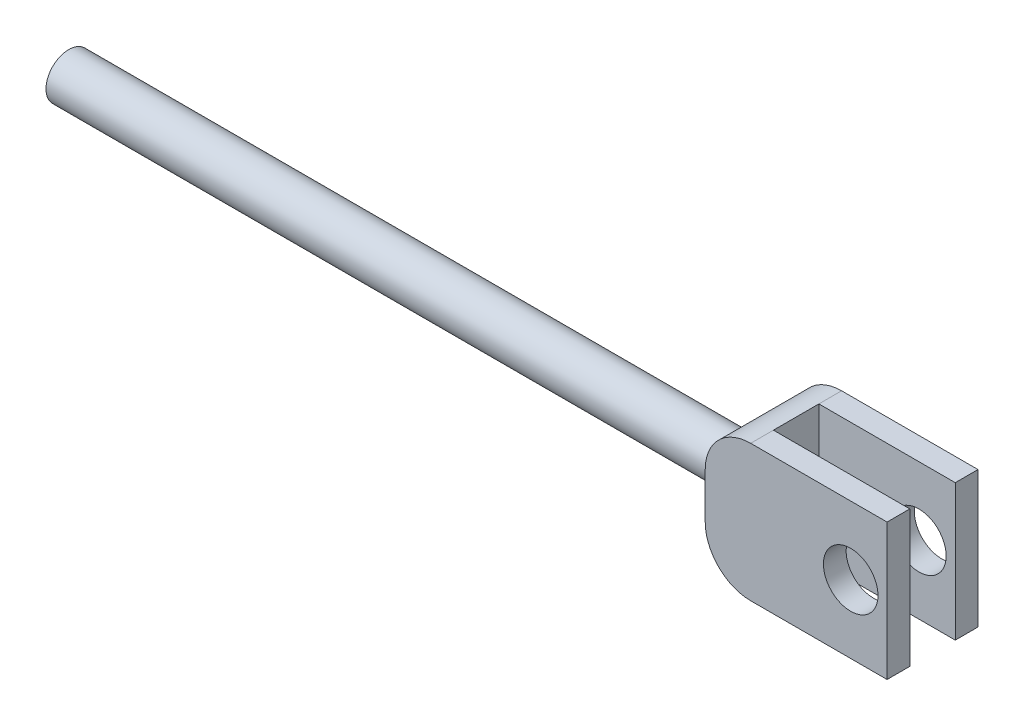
ISO-10303-21;
HEADER;
FILE_DESCRIPTION(('STEP AP214'),'2;1');
FILE_NAME('part.step','',(''),(''),'','','');
FILE_SCHEMA(('AUTOMOTIVE_DESIGN { 1 0 10303 214 1 1 1 1 }'));
ENDSEC;
DATA;
#1=APPLICATION_CONTEXT('core data for automotive mechanical design processes');
#2=APPLICATION_PROTOCOL_DEFINITION('international standard','automotive_design',2000,#1);
#3=PRODUCT_CONTEXT('',#1,'mechanical');
#4=PRODUCT('Part','Part','',(#3));
#5=PRODUCT_RELATED_PRODUCT_CATEGORY('part','',(#4));
#6=PRODUCT_DEFINITION_FORMATION('','',#4);
#7=PRODUCT_DEFINITION_CONTEXT('part definition',#1,'design');
#8=PRODUCT_DEFINITION('design','',#6,#7);
#9=PRODUCT_DEFINITION_SHAPE('','',#8);
#10=(LENGTH_UNIT() NAMED_UNIT(*) SI_UNIT(.MILLI.,.METRE.));
#11=(NAMED_UNIT(*) PLANE_ANGLE_UNIT() SI_UNIT($,.RADIAN.));
#12=(NAMED_UNIT(*) SI_UNIT($,.STERADIAN.) SOLID_ANGLE_UNIT());
#13=UNCERTAINTY_MEASURE_WITH_UNIT(LENGTH_MEASURE(1.E-05),#10,'distance_accuracy_value','');
#14=(GEOMETRIC_REPRESENTATION_CONTEXT(3) GLOBAL_UNCERTAINTY_ASSIGNED_CONTEXT((#13)) GLOBAL_UNIT_ASSIGNED_CONTEXT((#10,
#11,#12)) REPRESENTATION_CONTEXT('',''));
#15=CARTESIAN_POINT('',(0.,0.,0.));
#16=DIRECTION('',(0.,0.,1.));
#17=DIRECTION('',(1.,0.,0.));
#18=AXIS2_PLACEMENT_3D('',#15,#16,#17);
#19=CARTESIAN_POINT('',(-40.,30.,20.));
#20=DIRECTION('',(1.,0.,0.));
#21=DIRECTION('',(0.,1.,0.));
#22=AXIS2_PLACEMENT_3D('',#19,#20,#21);
#23=PLANE('',#22);
#24=CARTESIAN_POINT('',(-40.,15.,10.));
#25=DIRECTION('',(-1.,0.,0.));
#26=DIRECTION('',(0.,-1.,0.));
#27=AXIS2_PLACEMENT_3D('',#24,#25,#26);
#28=CIRCLE('',#27,5.);
#29=CARTESIAN_POINT('',(-40.,20.,10.));
#30=VERTEX_POINT('',#29);
#31=CARTESIAN_POINT('',(-40.,9.99999999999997,10.));
#32=VERTEX_POINT('',#31);
#33=EDGE_CURVE('E135',#30,#32,#28,.T.);
#34=ORIENTED_EDGE('',*,*,#33,.F.);
#35=DIRECTION('',(0.,0.,-1.));
#36=VECTOR('',#35,1.);
#37=CARTESIAN_POINT('',(-40.,20.,20.));
#38=LINE('',#37,#36);
#39=CARTESIAN_POINT('',(-40.,20.,0.));
#40=VERTEX_POINT('',#39);
#41=EDGE_CURVE('E123',#30,#40,#38,.T.);
#42=ORIENTED_EDGE('',*,*,#41,.T.);
#43=DIRECTION('',(0.,-1.,0.));
#44=VECTOR('',#43,1.);
#45=CARTESIAN_POINT('',(-40.,30.,0.));
#46=LINE('',#45,#44);
#47=CARTESIAN_POINT('',(-40.,9.99999999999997,0.));
#48=VERTEX_POINT('',#47);
#49=EDGE_CURVE('E194',#40,#48,#46,.T.);
#50=ORIENTED_EDGE('',*,*,#49,.T.);
#51=DIRECTION('',(0.,0.,-1.));
#52=VECTOR('',#51,1.);
#53=CARTESIAN_POINT('',(-40.,9.99999999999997,20.));
#54=LINE('',#53,#52);
#55=EDGE_CURVE('E137',#48,#32,#54,.F.);
#56=ORIENTED_EDGE('',*,*,#55,.T.);
#57=EDGE_LOOP('',(#34,#42,#50,#56));
#58=FACE_BOUND('',#57,.T.);
#59=ADVANCED_FACE('F31',(#58),#23,.F.);
#60=EDGE_CURVE('E48',#32,#30,#28,.T.);
#61=ORIENTED_EDGE('',*,*,#60,.F.);
#62=CARTESIAN_POINT('',(-40.,9.99999999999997,20.));
#63=VERTEX_POINT('',#62);
#64=EDGE_CURVE('E122',#32,#63,#54,.F.);
#65=ORIENTED_EDGE('',*,*,#64,.T.);
#66=DIRECTION('',(0.,-1.,0.));
#67=VECTOR('',#66,1.);
#68=CARTESIAN_POINT('',(-40.,30.,20.));
#69=LINE('',#68,#67);
#70=CARTESIAN_POINT('',(-40.,20.,20.));
#71=VERTEX_POINT('',#70);
#72=EDGE_CURVE('E119',#71,#63,#69,.T.);
#73=ORIENTED_EDGE('',*,*,#72,.F.);
#74=EDGE_CURVE('E115',#71,#30,#38,.T.);
#75=ORIENTED_EDGE('',*,*,#74,.T.);
#76=EDGE_LOOP('',(#61,#65,#73,#75));
#77=FACE_BOUND('',#76,.T.);
#78=ADVANCED_FACE('F117',(#77),#23,.F.);
#79=CARTESIAN_POINT('',(0.,30.,20.));
#80=DIRECTION('',(-1.,0.,0.));
#81=DIRECTION('',(0.,-1.,0.));
#82=AXIS2_PLACEMENT_3D('',#79,#80,#81);
#83=PLANE('',#82);
#84=DIRECTION('',(0.,0.,-1.));
#85=VECTOR('',#84,1.);
#86=CARTESIAN_POINT('',(0.,0.,20.));
#87=LINE('',#86,#85);
#88=CARTESIAN_POINT('',(0.,0.,20.));
#89=VERTEX_POINT('',#88);
#90=CARTESIAN_POINT('',(0.,0.,15.));
#91=VERTEX_POINT('',#90);
#92=EDGE_CURVE('E198',#89,#91,#87,.T.);
#93=ORIENTED_EDGE('',*,*,#92,.T.);
#94=DIRECTION('',(0.,-1.,0.));
#95=VECTOR('',#94,1.);
#96=CARTESIAN_POINT('',(0.,56.0547404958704,15.));
#97=LINE('',#96,#95);
#98=CARTESIAN_POINT('',(0.,30.,15.));
#99=VERTEX_POINT('',#98);
#100=EDGE_CURVE('E154',#99,#91,#97,.T.);
#101=ORIENTED_EDGE('',*,*,#100,.F.);
#102=DIRECTION('',(0.,0.,-1.));
#103=VECTOR('',#102,1.);
#104=CARTESIAN_POINT('',(0.,30.,20.));
#105=LINE('',#104,#103);
#106=CARTESIAN_POINT('',(0.,30.,20.));
#107=VERTEX_POINT('',#106);
#108=EDGE_CURVE('E202',#107,#99,#105,.T.);
#109=ORIENTED_EDGE('',*,*,#108,.F.);
#110=DIRECTION('',(0.,1.,0.));
#111=VECTOR('',#110,1.);
#112=CARTESIAN_POINT('',(0.,30.,20.));
#113=LINE('',#112,#111);
#114=EDGE_CURVE('E178',#89,#107,#113,.T.);
#115=ORIENTED_EDGE('',*,*,#114,.F.);
#116=EDGE_LOOP('',(#93,#101,#109,#115));
#117=FACE_BOUND('',#116,.T.);
#118=ADVANCED_FACE('F232',(#117),#83,.F.);
#119=CARTESIAN_POINT('',(0.,30.,20.));
#120=DIRECTION('',(0.,-1.,0.));
#121=DIRECTION('',(1.,0.,0.));
#122=AXIS2_PLACEMENT_3D('',#119,#120,#121);
#123=PLANE('',#122);
#124=ORIENTED_EDGE('',*,*,#108,.T.);
#125=DIRECTION('',(-1.,0.,0.));
#126=VECTOR('',#125,1.);
#127=CARTESIAN_POINT('',(0.,30.,15.));
#128=LINE('',#127,#126);
#129=CARTESIAN_POINT('',(-30.,30.,15.));
#130=VERTEX_POINT('',#129);
#131=EDGE_CURVE('E174',#99,#130,#128,.T.);
#132=ORIENTED_EDGE('',*,*,#131,.T.);
#133=DIRECTION('',(0.,0.,-1.));
#134=VECTOR('',#133,1.);
#135=CARTESIAN_POINT('',(-30.,30.,20.));
#136=LINE('',#135,#134);
#137=CARTESIAN_POINT('',(-30.,30.,20.));
#138=VERTEX_POINT('',#137);
#139=EDGE_CURVE('E41',#130,#138,#136,.F.);
#140=ORIENTED_EDGE('',*,*,#139,.T.);
#141=DIRECTION('',(-1.,0.,0.));
#142=VECTOR('',#141,1.);
#143=CARTESIAN_POINT('',(0.,30.,20.));
#144=LINE('',#143,#142);
#145=EDGE_CURVE('E181',#107,#138,#144,.T.);
#146=ORIENTED_EDGE('',*,*,#145,.F.);
#147=EDGE_LOOP('',(#124,#132,#140,#146));
#148=FACE_BOUND('',#147,.T.);
#149=ADVANCED_FACE('F226',(#148),#123,.F.);
#150=CARTESIAN_POINT('',(0.,0.,20.));
#151=DIRECTION('',(0.,1.,0.));
#152=DIRECTION('',(-1.,0.,0.));
#153=AXIS2_PLACEMENT_3D('',#150,#151,#152);
#154=PLANE('',#153);
#155=DIRECTION('',(0.,0.,-1.));
#156=VECTOR('',#155,1.);
#157=CARTESIAN_POINT('',(-30.,0.,20.));
#158=LINE('',#157,#156);
#159=CARTESIAN_POINT('',(-30.,0.,20.));
#160=VERTEX_POINT('',#159);
#161=CARTESIAN_POINT('',(-30.,0.,15.));
#162=VERTEX_POINT('',#161);
#163=EDGE_CURVE('E206',#160,#162,#158,.T.);
#164=ORIENTED_EDGE('',*,*,#163,.T.);
#165=DIRECTION('',(1.,0.,0.));
#166=VECTOR('',#165,1.);
#167=CARTESIAN_POINT('',(0.,0.,15.));
#168=LINE('',#167,#166);
#169=EDGE_CURVE('E171',#162,#91,#168,.T.);
#170=ORIENTED_EDGE('',*,*,#169,.T.);
#171=ORIENTED_EDGE('',*,*,#92,.F.);
#172=DIRECTION('',(1.,0.,0.));
#173=VECTOR('',#172,1.);
#174=CARTESIAN_POINT('',(0.,0.,20.));
#175=LINE('',#174,#173);
#176=EDGE_CURVE('E186',#160,#89,#175,.T.);
#177=ORIENTED_EDGE('',*,*,#176,.F.);
#178=EDGE_LOOP('',(#164,#170,#171,#177));
#179=FACE_BOUND('',#178,.T.);
#180=ADVANCED_FACE('F234',(#179),#154,.F.);
#181=CARTESIAN_POINT('',(0.,30.,5.));
#182=VERTEX_POINT('',#181);
#183=CARTESIAN_POINT('',(0.,30.,0.));
#184=VERTEX_POINT('',#183);
#185=EDGE_CURVE('E201',#182,#184,#105,.T.);
#186=ORIENTED_EDGE('',*,*,#185,.F.);
#187=DIRECTION('',(0.,1.,0.));
#188=VECTOR('',#187,1.);
#189=CARTESIAN_POINT('',(0.,56.0547404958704,5.));
#190=LINE('',#189,#188);
#191=CARTESIAN_POINT('',(0.,0.,4.99999999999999));
#192=VERTEX_POINT('',#191);
#193=EDGE_CURVE('E158',#192,#182,#190,.T.);
#194=ORIENTED_EDGE('',*,*,#193,.F.);
#195=CARTESIAN_POINT('',(0.,0.,0.));
#196=VERTEX_POINT('',#195);
#197=EDGE_CURVE('E188',#192,#196,#87,.T.);
#198=ORIENTED_EDGE('',*,*,#197,.T.);
#199=DIRECTION('',(0.,1.,0.));
#200=VECTOR('',#199,1.);
#201=CARTESIAN_POINT('',(0.,30.,0.));
#202=LINE('',#201,#200);
#203=EDGE_CURVE('E177',#196,#184,#202,.T.);
#204=ORIENTED_EDGE('',*,*,#203,.T.);
#205=EDGE_LOOP('',(#186,#194,#198,#204));
#206=FACE_BOUND('',#205,.T.);
#207=ADVANCED_FACE('F250',(#206),#83,.F.);
#208=CARTESIAN_POINT('',(-30.,30.,0.));
#209=VERTEX_POINT('',#208);
#210=CARTESIAN_POINT('',(-30.,30.,4.99999999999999));
#211=VERTEX_POINT('',#210);
#212=EDGE_CURVE('E11',#209,#211,#136,.F.);
#213=ORIENTED_EDGE('',*,*,#212,.T.);
#214=DIRECTION('',(1.,0.,0.));
#215=VECTOR('',#214,1.);
#216=CARTESIAN_POINT('',(0.,30.,5.));
#217=LINE('',#216,#215);
#218=EDGE_CURVE('E168',#211,#182,#217,.T.);
#219=ORIENTED_EDGE('',*,*,#218,.T.);
#220=ORIENTED_EDGE('',*,*,#185,.T.);
#221=DIRECTION('',(-1.,0.,0.));
#222=VECTOR('',#221,1.);
#223=CARTESIAN_POINT('',(0.,30.,0.));
#224=LINE('',#223,#222);
#225=EDGE_CURVE('E191',#184,#209,#224,.T.);
#226=ORIENTED_EDGE('',*,*,#225,.T.);
#227=EDGE_LOOP('',(#213,#219,#220,#226));
#228=FACE_BOUND('',#227,.T.);
#229=ADVANCED_FACE('F252',(#228),#123,.F.);
#230=ORIENTED_EDGE('',*,*,#197,.F.);
#231=DIRECTION('',(-1.,0.,0.));
#232=VECTOR('',#231,1.);
#233=CARTESIAN_POINT('',(0.,0.,4.99999999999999));
#234=LINE('',#233,#232);
#235=CARTESIAN_POINT('',(-30.,0.,4.99999999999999));
#236=VERTEX_POINT('',#235);
#237=EDGE_CURVE('E165',#192,#236,#234,.T.);
#238=ORIENTED_EDGE('',*,*,#237,.T.);
#239=CARTESIAN_POINT('',(-30.,0.,0.));
#240=VERTEX_POINT('',#239);
#241=EDGE_CURVE('E205',#236,#240,#158,.T.);
#242=ORIENTED_EDGE('',*,*,#241,.T.);
#243=DIRECTION('',(1.,0.,0.));
#244=VECTOR('',#243,1.);
#245=CARTESIAN_POINT('',(0.,0.,0.));
#246=LINE('',#245,#244);
#247=EDGE_CURVE('E182',#240,#196,#246,.T.);
#248=ORIENTED_EDGE('',*,*,#247,.T.);
#249=EDGE_LOOP('',(#230,#238,#242,#248));
#250=FACE_BOUND('',#249,.T.);
#251=ADVANCED_FACE('F245',(#250),#154,.F.);
#252=CARTESIAN_POINT('',(0.,0.,20.));
#253=DIRECTION('',(0.,0.,-1.));
#254=DIRECTION('',(-1.,0.,0.));
#255=AXIS2_PLACEMENT_3D('',#252,#253,#254);
#256=PLANE('',#255);
#257=CARTESIAN_POINT('',(-7.99999999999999,15.,20.));
#258=DIRECTION('',(0.,0.,1.));
#259=DIRECTION('',(1.,0.,0.));
#260=AXIS2_PLACEMENT_3D('',#257,#258,#259);
#261=CIRCLE('',#260,6.);
#262=CARTESIAN_POINT('',(-1.99999999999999,15.,20.));
#263=VERTEX_POINT('',#262);
#264=EDGE_CURVE('E143',#263,#263,#261,.T.);
#265=ORIENTED_EDGE('',*,*,#264,.F.);
#266=EDGE_LOOP('',(#265));
#267=FACE_BOUND('',#266,.T.);
#268=ORIENTED_EDGE('',*,*,#72,.T.);
#269=CARTESIAN_POINT('',(-30.,9.99999999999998,20.));
#270=DIRECTION('',(0.,0.,-1.));
#271=DIRECTION('',(-1.,0.,0.));
#272=AXIS2_PLACEMENT_3D('',#269,#270,#271);
#273=CIRCLE('',#272,10.);
#274=EDGE_CURVE('E214',#63,#160,#273,.F.);
#275=ORIENTED_EDGE('',*,*,#274,.T.);
#276=ORIENTED_EDGE('',*,*,#176,.T.);
#277=ORIENTED_EDGE('',*,*,#114,.T.);
#278=ORIENTED_EDGE('',*,*,#145,.T.);
#279=CARTESIAN_POINT('',(-30.,20.,20.));
#280=DIRECTION('',(0.,0.,-1.));
#281=DIRECTION('',(-1.,0.,0.));
#282=AXIS2_PLACEMENT_3D('',#279,#280,#281);
#283=CIRCLE('',#282,10.);
#284=EDGE_CURVE('E212',#138,#71,#283,.F.);
#285=ORIENTED_EDGE('',*,*,#284,.T.);
#286=EDGE_LOOP('',(#268,#275,#276,#277,#278,#285));
#287=FACE_BOUND('',#286,.T.);
#288=ADVANCED_FACE('F228',(#267,#287),#256,.F.);
#289=CARTESIAN_POINT('',(0.,0.,0.));
#290=DIRECTION('',(0.,0.,-1.));
#291=DIRECTION('',(-1.,0.,0.));
#292=AXIS2_PLACEMENT_3D('',#289,#290,#291);
#293=PLANE('',#292);
#294=CARTESIAN_POINT('',(-7.99999999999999,15.,0.));
#295=DIRECTION('',(0.,0.,1.));
#296=DIRECTION('',(1.,0.,0.));
#297=AXIS2_PLACEMENT_3D('',#294,#295,#296);
#298=CIRCLE('',#297,6.);
#299=CARTESIAN_POINT('',(-1.99999999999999,15.,0.));
#300=VERTEX_POINT('',#299);
#301=EDGE_CURVE('E146',#300,#300,#298,.T.);
#302=ORIENTED_EDGE('',*,*,#301,.T.);
#303=EDGE_LOOP('',(#302));
#304=FACE_BOUND('',#303,.T.);
#305=ORIENTED_EDGE('',*,*,#247,.F.);
#306=CARTESIAN_POINT('',(-30.,9.99999999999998,0.));
#307=DIRECTION('',(0.,0.,-1.));
#308=DIRECTION('',(-1.,0.,0.));
#309=AXIS2_PLACEMENT_3D('',#306,#307,#308);
#310=CIRCLE('',#309,10.);
#311=EDGE_CURVE('E132',#240,#48,#310,.T.);
#312=ORIENTED_EDGE('',*,*,#311,.T.);
#313=ORIENTED_EDGE('',*,*,#49,.F.);
#314=CARTESIAN_POINT('',(-30.,20.,0.));
#315=DIRECTION('',(0.,0.,-1.));
#316=DIRECTION('',(-1.,0.,0.));
#317=AXIS2_PLACEMENT_3D('',#314,#315,#316);
#318=CIRCLE('',#317,10.);
#319=EDGE_CURVE('E128',#40,#209,#318,.T.);
#320=ORIENTED_EDGE('',*,*,#319,.T.);
#321=ORIENTED_EDGE('',*,*,#225,.F.);
#322=ORIENTED_EDGE('',*,*,#203,.F.);
#323=EDGE_LOOP('',(#305,#312,#313,#320,#321,#322));
#324=FACE_BOUND('',#323,.T.);
#325=ADVANCED_FACE('F255',(#304,#324),#293,.T.);
#326=CARTESIAN_POINT('',(-30.,9.99999999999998,20.));
#327=DIRECTION('',(0.,0.,-1.));
#328=DIRECTION('',(-1.,0.,0.));
#329=AXIS2_PLACEMENT_3D('',#326,#327,#328);
#330=CYLINDRICAL_SURFACE('',#329,10.);
#331=ORIENTED_EDGE('',*,*,#274,.F.);
#332=ORIENTED_EDGE('',*,*,#64,.F.);
#333=ORIENTED_EDGE('',*,*,#55,.F.);
#334=ORIENTED_EDGE('',*,*,#311,.F.);
#335=ORIENTED_EDGE('',*,*,#241,.F.);
#336=DIRECTION('',(0.,0.,-1.));
#337=VECTOR('',#336,1.);
#338=CARTESIAN_POINT('',(-30.,0.,20.));
#339=LINE('',#338,#337);
#340=EDGE_CURVE('E160',#236,#162,#339,.F.);
#341=ORIENTED_EDGE('',*,*,#340,.T.);
#342=ORIENTED_EDGE('',*,*,#163,.F.);
#343=EDGE_LOOP('',(#331,#332,#333,#334,#335,#341,#342));
#344=FACE_BOUND('',#343,.T.);
#345=ADVANCED_FACE('F237',(#344),#330,.T.);
#346=CARTESIAN_POINT('',(-30.,20.,20.));
#347=DIRECTION('',(0.,0.,-1.));
#348=DIRECTION('',(-1.,0.,0.));
#349=AXIS2_PLACEMENT_3D('',#346,#347,#348);
#350=CYLINDRICAL_SURFACE('',#349,10.);
#351=ORIENTED_EDGE('',*,*,#284,.F.);
#352=ORIENTED_EDGE('',*,*,#139,.F.);
#353=EDGE_CURVE('E40',#211,#130,#136,.F.);
#354=ORIENTED_EDGE('',*,*,#353,.F.);
#355=ORIENTED_EDGE('',*,*,#212,.F.);
#356=ORIENTED_EDGE('',*,*,#319,.F.);
#357=ORIENTED_EDGE('',*,*,#41,.F.);
#358=ORIENTED_EDGE('',*,*,#74,.F.);
#359=EDGE_LOOP('',(#351,#352,#354,#355,#356,#357,#358));
#360=FACE_BOUND('',#359,.T.);
#361=ADVANCED_FACE('F33',(#360),#350,.T.);
#362=CARTESIAN_POINT('',(-30.,56.0547404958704,15.));
#363=DIRECTION('',(0.,0.,1.));
#364=DIRECTION('',(0.,-1.,0.));
#365=AXIS2_PLACEMENT_3D('',#362,#363,#364);
#366=PLANE('',#365);
#367=CARTESIAN_POINT('',(-7.99999999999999,15.,15.));
#368=DIRECTION('',(0.,0.,1.));
#369=DIRECTION('',(0.,-1.,0.));
#370=AXIS2_PLACEMENT_3D('',#367,#368,#369);
#371=CIRCLE('',#370,6.);
#372=CARTESIAN_POINT('',(-7.99999999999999,8.99999999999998,15.));
#373=VERTEX_POINT('',#372);
#374=EDGE_CURVE('E151',#373,#373,#371,.T.);
#375=ORIENTED_EDGE('',*,*,#374,.T.);
#376=EDGE_LOOP('',(#375));
#377=FACE_BOUND('',#376,.T.);
#378=ORIENTED_EDGE('',*,*,#100,.T.);
#379=ORIENTED_EDGE('',*,*,#169,.F.);
#380=DIRECTION('',(0.,-1.,0.));
#381=VECTOR('',#380,1.);
#382=CARTESIAN_POINT('',(-30.,56.0547404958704,15.));
#383=LINE('',#382,#381);
#384=EDGE_CURVE('E155',#130,#162,#383,.T.);
#385=ORIENTED_EDGE('',*,*,#384,.F.);
#386=ORIENTED_EDGE('',*,*,#131,.F.);
#387=EDGE_LOOP('',(#378,#379,#385,#386));
#388=FACE_BOUND('',#387,.T.);
#389=ADVANCED_FACE('F224',(#377,#388),#366,.F.);
#390=CARTESIAN_POINT('',(-30.,56.0547404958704,5.));
#391=DIRECTION('',(0.,0.,-1.));
#392=DIRECTION('',(0.,1.,0.));
#393=AXIS2_PLACEMENT_3D('',#390,#391,#392);
#394=PLANE('',#393);
#395=CARTESIAN_POINT('',(-7.99999999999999,15.,4.99999999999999));
#396=DIRECTION('',(0.,0.,-1.));
#397=DIRECTION('',(0.,1.,0.));
#398=AXIS2_PLACEMENT_3D('',#395,#396,#397);
#399=CIRCLE('',#398,6.);
#400=CARTESIAN_POINT('',(-7.99999999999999,21.,4.99999999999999));
#401=VERTEX_POINT('',#400);
#402=EDGE_CURVE('E35',#401,#401,#399,.T.);
#403=ORIENTED_EDGE('',*,*,#402,.T.);
#404=EDGE_LOOP('',(#403));
#405=FACE_BOUND('',#404,.T.);
#406=DIRECTION('',(0.,1.,0.));
#407=VECTOR('',#406,1.);
#408=CARTESIAN_POINT('',(-30.,56.0547404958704,5.));
#409=LINE('',#408,#407);
#410=EDGE_CURVE('E56',#236,#211,#409,.T.);
#411=ORIENTED_EDGE('',*,*,#410,.F.);
#412=ORIENTED_EDGE('',*,*,#237,.F.);
#413=ORIENTED_EDGE('',*,*,#193,.T.);
#414=ORIENTED_EDGE('',*,*,#218,.F.);
#415=EDGE_LOOP('',(#411,#412,#413,#414));
#416=FACE_BOUND('',#415,.T.);
#417=ADVANCED_FACE('F241',(#405,#416),#394,.F.);
#418=CARTESIAN_POINT('',(-30.,-8.67992092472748,15.));
#419=DIRECTION('',(1.,0.,0.));
#420=DIRECTION('',(0.,1.,0.));
#421=AXIS2_PLACEMENT_3D('',#418,#419,#420);
#422=PLANE('',#421);
#423=ORIENTED_EDGE('',*,*,#410,.T.);
#424=ORIENTED_EDGE('',*,*,#353,.T.);
#425=ORIENTED_EDGE('',*,*,#384,.T.);
#426=ORIENTED_EDGE('',*,*,#340,.F.);
#427=EDGE_LOOP('',(#423,#424,#425,#426));
#428=FACE_BOUND('',#427,.T.);
#429=ADVANCED_FACE('F222',(#428),#422,.T.);
#430=CARTESIAN_POINT('',(-7.99999999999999,15.,0.));
#431=DIRECTION('',(0.,0.,1.));
#432=DIRECTION('',(1.,0.,0.));
#433=AXIS2_PLACEMENT_3D('',#430,#431,#432);
#434=CYLINDRICAL_SURFACE('',#433,6.);
#435=ORIENTED_EDGE('',*,*,#301,.F.);
#436=EDGE_LOOP('',(#435));
#437=FACE_BOUND('',#436,.T.);
#438=ORIENTED_EDGE('',*,*,#402,.F.);
#439=EDGE_LOOP('',(#438));
#440=FACE_BOUND('',#439,.T.);
#441=ADVANCED_FACE('F316',(#437,#440),#434,.F.);
#442=ORIENTED_EDGE('',*,*,#264,.T.);
#443=EDGE_LOOP('',(#442));
#444=FACE_BOUND('',#443,.T.);
#445=ORIENTED_EDGE('',*,*,#374,.F.);
#446=EDGE_LOOP('',(#445));
#447=FACE_BOUND('',#446,.T.);
#448=ADVANCED_FACE('F355',(#444,#447),#434,.F.);
#449=CARTESIAN_POINT('',(-190.,14.9999999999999,10.));
#450=DIRECTION('',(1.,0.,0.));
#451=DIRECTION('',(0.,1.,0.));
#452=AXIS2_PLACEMENT_3D('',#449,#450,#451);
#453=CYLINDRICAL_SURFACE('',#452,5.);
#454=CARTESIAN_POINT('',(-190.,14.9999999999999,10.));
#455=DIRECTION('',(-1.,0.,0.));
#456=DIRECTION('',(0.,-1.,0.));
#457=AXIS2_PLACEMENT_3D('',#454,#455,#456);
#458=CIRCLE('',#457,5.);
#459=CARTESIAN_POINT('',(-190.,9.9999999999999,10.));
#460=VERTEX_POINT('',#459);
#461=EDGE_CURVE('E141',#460,#460,#458,.T.);
#462=ORIENTED_EDGE('',*,*,#461,.F.);
#463=EDGE_LOOP('',(#462));
#464=FACE_BOUND('',#463,.T.);
#465=ORIENTED_EDGE('',*,*,#60,.T.);
#466=ORIENTED_EDGE('',*,*,#33,.T.);
#467=EDGE_LOOP('',(#465,#466));
#468=FACE_BOUND('',#467,.T.);
#469=ADVANCED_FACE('F140',(#464,#468),#453,.T.);
#470=CARTESIAN_POINT('',(-190.,14.9999999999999,10.));
#471=DIRECTION('',(-1.,0.,0.));
#472=DIRECTION('',(0.,-1.,0.));
#473=AXIS2_PLACEMENT_3D('',#470,#471,#472);
#474=PLANE('',#473);
#475=ORIENTED_EDGE('',*,*,#461,.T.);
#476=EDGE_LOOP('',(#475));
#477=FACE_BOUND('',#476,.T.);
#478=ADVANCED_FACE('F393',(#477),#474,.T.);
#479=CLOSED_SHELL('',(#59,#78,#118,#149,#180,#207,#229,#251,#288,#325,#345,#361,#389,#417,#429,
#441,#448,#469,#478));
#480=MANIFOLD_SOLID_BREP('B2',#479);
#481=ADVANCED_BREP_SHAPE_REPRESENTATION('',(#18,#480),#14);
#482=SHAPE_DEFINITION_REPRESENTATION(#9,#481);
ENDSEC;
END-ISO-10303-21;
